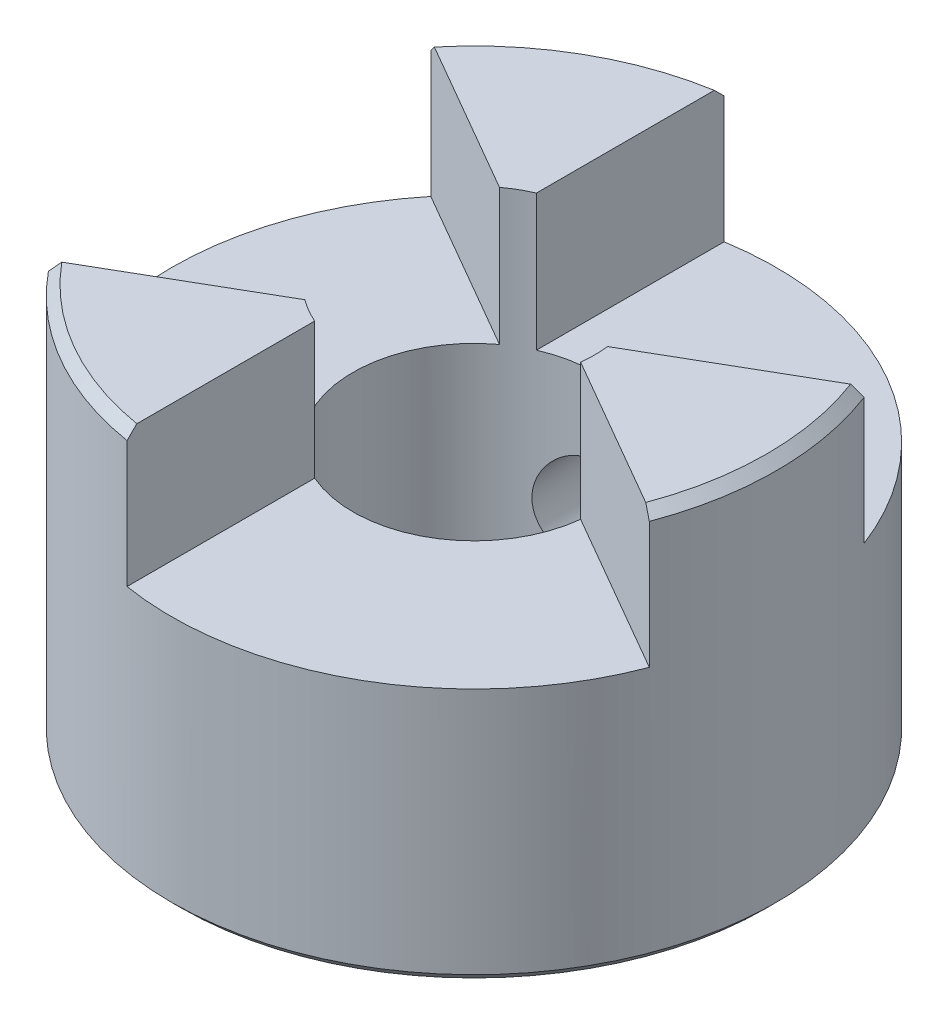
ISO-10303-21;
HEADER;
FILE_DESCRIPTION(('STEP AP214'),'2;1');
FILE_NAME('part.step','',(''),(''),'','','');
FILE_SCHEMA(('AUTOMOTIVE_DESIGN { 1 0 10303 214 1 1 1 1 }'));
ENDSEC;
DATA;
#1=APPLICATION_CONTEXT('core data for automotive mechanical design processes');
#2=APPLICATION_PROTOCOL_DEFINITION('international standard','automotive_design',2000,#1);
#3=PRODUCT_CONTEXT('',#1,'mechanical');
#4=PRODUCT('Part','Part','',(#3));
#5=PRODUCT_RELATED_PRODUCT_CATEGORY('part','',(#4));
#6=PRODUCT_DEFINITION_FORMATION('','',#4);
#7=PRODUCT_DEFINITION_CONTEXT('part definition',#1,'design');
#8=PRODUCT_DEFINITION('design','',#6,#7);
#9=PRODUCT_DEFINITION_SHAPE('','',#8);
#10=(LENGTH_UNIT() NAMED_UNIT(*) SI_UNIT(.MILLI.,.METRE.));
#11=(NAMED_UNIT(*) PLANE_ANGLE_UNIT() SI_UNIT($,.RADIAN.));
#12=(NAMED_UNIT(*) SI_UNIT($,.STERADIAN.) SOLID_ANGLE_UNIT());
#13=UNCERTAINTY_MEASURE_WITH_UNIT(LENGTH_MEASURE(1.E-05),#10,'distance_accuracy_value','');
#14=(GEOMETRIC_REPRESENTATION_CONTEXT(3) GLOBAL_UNCERTAINTY_ASSIGNED_CONTEXT((#13)) GLOBAL_UNIT_ASSIGNED_CONTEXT((#10,
#11,#12)) REPRESENTATION_CONTEXT('',''));
#15=CARTESIAN_POINT('',(0.,0.,0.));
#16=DIRECTION('',(0.,0.,1.));
#17=DIRECTION('',(1.,0.,0.));
#18=AXIS2_PLACEMENT_3D('',#15,#16,#17);
#19=CARTESIAN_POINT('',(0.,6.746875,0.));
#20=DIRECTION('',(0.,1.,0.));
#21=DIRECTION('',(0.,0.,1.));
#22=AXIS2_PLACEMENT_3D('',#19,#20,#21);
#23=PLANE('',#22);
#24=CARTESIAN_POINT('',(0.,6.746875,0.));
#25=DIRECTION('',(0.,1.,0.));
#26=DIRECTION('',(0.,0.,1.));
#27=AXIS2_PLACEMENT_3D('',#24,#25,#26);
#28=CIRCLE('',#27,3.175);
#29=CARTESIAN_POINT('',(3.15507812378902,6.746875,-0.355115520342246));
#30=VERTEX_POINT('',#29);
#31=CARTESIAN_POINT('',(-1.26999999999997,6.746875,-2.90993556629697));
#32=VERTEX_POINT('',#31);
#33=EDGE_CURVE('E176',#30,#32,#28,.T.);
#34=ORIENTED_EDGE('',*,*,#33,.F.);
#35=DIRECTION('',(-0.866025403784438,0.,0.500000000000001));
#36=VECTOR('',#35,1.);
#37=CARTESIAN_POINT('',(2.53999999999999,6.746875,0.));
#38=LINE('',#37,#36);
#39=CARTESIAN_POINT('',(7.42051801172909,6.746875,-2.81776838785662));
#40=VERTEX_POINT('',#39);
#41=EDGE_CURVE('E334',#40,#30,#38,.T.);
#42=ORIENTED_EDGE('',*,*,#41,.F.);
#43=CARTESIAN_POINT('',(0.,6.746875,0.));
#44=DIRECTION('',(0.,1.,0.));
#45=DIRECTION('',(0.,0.,1.));
#46=AXIS2_PLACEMENT_3D('',#43,#44,#45);
#47=CIRCLE('',#46,7.9375);
#48=CARTESIAN_POINT('',(-1.26999999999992,6.746875,-7.83524130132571));
#49=VERTEX_POINT('',#48);
#50=EDGE_CURVE('E168',#40,#49,#47,.T.);
#51=ORIENTED_EDGE('',*,*,#50,.T.);
#52=DIRECTION('',(0.,0.,-1.));
#53=VECTOR('',#52,1.);
#54=CARTESIAN_POINT('',(-1.26999999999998,6.746875,-2.19970452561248));
#55=LINE('',#54,#53);
#56=EDGE_CURVE('E207',#32,#49,#55,.T.);
#57=ORIENTED_EDGE('',*,*,#56,.F.);
#58=EDGE_LOOP('',(#34,#42,#51,#57));
#59=FACE_BOUND('',#58,.T.);
#60=ADVANCED_FACE('F35',(#59),#23,.T.);
#61=CARTESIAN_POINT('',(-1.885078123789,6.746875,-2.55482004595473));
#62=VERTEX_POINT('',#61);
#63=CARTESIAN_POINT('',(-1.88507812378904,6.746875,2.5548200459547));
#64=VERTEX_POINT('',#63);
#65=EDGE_CURVE('E174',#62,#64,#28,.T.);
#66=ORIENTED_EDGE('',*,*,#65,.F.);
#67=DIRECTION('',(0.866025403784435,0.,0.500000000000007));
#68=VECTOR('',#67,1.);
#69=CARTESIAN_POINT('',(-1.26999999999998,6.746875,-2.19970452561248));
#70=LINE('',#69,#68);
#71=CARTESIAN_POINT('',(-6.15051801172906,6.746875,-5.01747291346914));
#72=VERTEX_POINT('',#71);
#73=EDGE_CURVE('E173',#72,#62,#70,.T.);
#74=ORIENTED_EDGE('',*,*,#73,.F.);
#75=CARTESIAN_POINT('',(-6.15051801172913,6.746875,5.01747291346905));
#76=VERTEX_POINT('',#75);
#77=EDGE_CURVE('E358',#72,#76,#47,.T.);
#78=ORIENTED_EDGE('',*,*,#77,.T.);
#79=DIRECTION('',(-0.866025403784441,0.,0.499999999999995));
#80=VECTOR('',#79,1.);
#81=CARTESIAN_POINT('',(-1.27000000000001,6.746875,2.19970452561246));
#82=LINE('',#81,#80);
#83=EDGE_CURVE('E313',#64,#76,#82,.T.);
#84=ORIENTED_EDGE('',*,*,#83,.F.);
#85=EDGE_LOOP('',(#66,#74,#78,#84));
#86=FACE_BOUND('',#85,.T.);
#87=ADVANCED_FACE('F283',(#86),#23,.T.);
#88=CARTESIAN_POINT('',(-1.27000000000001,6.746875,2.90993556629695));
#89=VERTEX_POINT('',#88);
#90=CARTESIAN_POINT('',(3.15507812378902,6.746875,0.355115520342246));
#91=VERTEX_POINT('',#90);
#92=EDGE_CURVE('E178',#89,#91,#28,.T.);
#93=ORIENTED_EDGE('',*,*,#92,.F.);
#94=DIRECTION('',(0.,0.,-1.));
#95=VECTOR('',#94,1.);
#96=CARTESIAN_POINT('',(-1.27000000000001,6.746875,2.19970452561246));
#97=LINE('',#96,#95);
#98=CARTESIAN_POINT('',(-1.27000000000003,6.746875,7.83524130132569));
#99=VERTEX_POINT('',#98);
#100=EDGE_CURVE('E306',#99,#89,#97,.T.);
#101=ORIENTED_EDGE('',*,*,#100,.F.);
#102=CARTESIAN_POINT('',(7.42051801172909,6.746875,2.81776838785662));
#103=VERTEX_POINT('',#102);
#104=EDGE_CURVE('E356',#99,#103,#47,.T.);
#105=ORIENTED_EDGE('',*,*,#104,.T.);
#106=DIRECTION('',(0.866025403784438,0.,0.500000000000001));
#107=VECTOR('',#106,1.);
#108=CARTESIAN_POINT('',(2.53999999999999,6.746875,0.));
#109=LINE('',#108,#107);
#110=EDGE_CURVE('E309',#91,#103,#109,.T.);
#111=ORIENTED_EDGE('',*,*,#110,.F.);
#112=EDGE_LOOP('',(#93,#101,#105,#111));
#113=FACE_BOUND('',#112,.T.);
#114=ADVANCED_FACE('F285',(#113),#23,.T.);
#115=CARTESIAN_POINT('',(0.,6.746875,0.));
#116=DIRECTION('',(0.,-1.,0.));
#117=DIRECTION('',(0.,0.,-1.));
#118=AXIS2_PLACEMENT_3D('',#115,#116,#117);
#119=CYLINDRICAL_SURFACE('',#118,7.9375);
#120=CARTESIAN_POINT('',(0.,4.8968812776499,-7.9375));
#121=CARTESIAN_POINT('',(0.0257225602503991,4.89690131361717,-7.93750336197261));
#122=CARTESIAN_POINT('',(0.0514445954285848,4.89627769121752,-7.93736567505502));
#123=CARTESIAN_POINT('',(0.102786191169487,4.89376404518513,-7.93682267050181));
#124=CARTESIAN_POINT('',(0.128405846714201,4.89187588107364,-7.93641774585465));
#125=CARTESIAN_POINT('',(0.179488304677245,4.88685684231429,-7.93535525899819));
#126=CARTESIAN_POINT('',(0.204951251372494,4.88372737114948,-7.93469798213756));
#127=CARTESIAN_POINT('',(0.255666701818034,4.87624978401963,-7.93314587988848));
#128=CARTESIAN_POINT('',(0.280919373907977,4.87190276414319,-7.93225126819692));
#129=CARTESIAN_POINT('',(0.331160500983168,4.8620138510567,-7.93023951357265));
#130=CARTESIAN_POINT('',(0.356149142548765,4.85647287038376,-7.92912254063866));
#131=CARTESIAN_POINT('',(0.40580848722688,4.84421972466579,-7.92668106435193));
#132=CARTESIAN_POINT('',(0.430479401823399,4.83750838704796,-7.92535670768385));
#133=CARTESIAN_POINT('',(0.479449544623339,4.8229381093,-7.92251544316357));
#134=CARTESIAN_POINT('',(0.503749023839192,4.81507998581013,-7.92099867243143));
#135=CARTESIAN_POINT('',(0.551922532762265,4.79823964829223,-7.91778754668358));
#136=CARTESIAN_POINT('',(0.575796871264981,4.78925829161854,-7.91609332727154));
#137=CARTESIAN_POINT('',(0.623066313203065,4.77019494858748,-7.91254226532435));
#138=CARTESIAN_POINT('',(0.646461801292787,4.76011389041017,-7.91068556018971));
#139=CARTESIAN_POINT('',(0.692719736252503,4.73887457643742,-7.9068244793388));
#140=CARTESIAN_POINT('',(0.715582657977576,4.72771732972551,-7.90482024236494));
#141=CARTESIAN_POINT('',(0.760721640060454,4.70434905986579,-7.90067907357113));
#142=CARTESIAN_POINT('',(0.78299827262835,4.69213911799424,-7.8985422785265));
#143=CARTESIAN_POINT('',(0.82691084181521,4.66668889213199,-7.89415088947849));
#144=CARTESIAN_POINT('',(0.84854744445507,4.65344973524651,-7.89189642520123));
#145=CARTESIAN_POINT('',(0.891126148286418,4.6259645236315,-7.88728490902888));
#146=CARTESIAN_POINT('',(0.912068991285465,4.61171959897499,-7.88492797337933));
#147=CARTESIAN_POINT('',(0.953206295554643,4.58224639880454,-7.88012557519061));
#148=CARTESIAN_POINT('',(0.973401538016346,4.567019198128,-7.87768021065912));
#149=CARTESIAN_POINT('',(1.01299014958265,4.53560482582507,-7.87271932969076));
#150=CARTESIAN_POINT('',(1.0323842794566,4.519418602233,-7.87020388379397));
#151=CARTESIAN_POINT('',(1.07031593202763,4.48611047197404,-7.86510516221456));
#152=CARTESIAN_POINT('',(1.08885410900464,4.46898930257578,-7.86252194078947));
#153=CARTESIAN_POINT('',(1.12500974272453,4.43384646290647,-7.8573518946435));
#154=CARTESIAN_POINT('',(1.14262833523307,4.41582595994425,-7.85476507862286));
#155=CARTESIAN_POINT('',(1.17690832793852,4.37894752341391,-7.84965304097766));
#156=CARTESIAN_POINT('',(1.19357134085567,4.36009110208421,-7.84712771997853));
#157=CARTESIAN_POINT('',(1.22591459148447,4.32159443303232,-7.84214185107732));
#158=CARTESIAN_POINT('',(1.24159627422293,4.30195541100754,-7.83968121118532));
#159=CARTESIAN_POINT('',(1.2719525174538,4.26194618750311,-7.83484389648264));
#160=CARTESIAN_POINT('',(1.28662840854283,4.24157700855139,-7.83246711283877));
#161=CARTESIAN_POINT('',(1.31494831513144,4.20016026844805,-7.82781242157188));
#162=CARTESIAN_POINT('',(1.32859359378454,4.1791135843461,-7.82553439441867));
#163=CARTESIAN_POINT('',(1.35482756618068,4.13639451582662,-7.82109327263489));
#164=CARTESIAN_POINT('',(1.36741749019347,4.11472290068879,-7.81893004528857));
#165=CARTESIAN_POINT('',(1.39151598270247,4.07080663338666,-7.81473427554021));
#166=CARTESIAN_POINT('',(1.40302576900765,4.04856266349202,-7.81270158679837));
#167=CARTESIAN_POINT('',(1.42493920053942,4.00355432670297,-7.8087827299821));
#168=CARTESIAN_POINT('',(1.4353440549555,3.98079056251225,-7.80689640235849));
#169=CARTESIAN_POINT('',(1.45502283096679,3.93479527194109,-7.80328608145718));
#170=CARTESIAN_POINT('',(1.46429793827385,3.91156426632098,-7.80156191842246));
#171=CARTESIAN_POINT('',(1.48169244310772,3.864687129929,-7.79829174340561));
#172=CARTESIAN_POINT('',(1.48981296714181,3.84104142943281,-7.79674555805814));
#173=CARTESIAN_POINT('',(1.50487356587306,3.79338754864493,-7.79384714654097));
#174=CARTESIAN_POINT('',(1.51181464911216,3.76937969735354,-7.79249475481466));
#175=CARTESIAN_POINT('',(1.5244916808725,3.7210541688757,-7.78999972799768));
#176=CARTESIAN_POINT('',(1.53022843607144,3.69673671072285,-7.78885695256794));
#177=CARTESIAN_POINT('',(1.54047223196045,3.64784463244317,-7.78679693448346));
#178=CARTESIAN_POINT('',(1.54497976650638,3.62327011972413,-7.78587960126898));
#179=CARTESIAN_POINT('',(1.55274057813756,3.57391658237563,-7.78428622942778));
#180=CARTESIAN_POINT('',(1.55599389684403,3.54913756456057,-7.78361018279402));
#181=CARTESIAN_POINT('',(1.5612221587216,3.49942769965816,-7.78251506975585));
#182=CARTESIAN_POINT('',(1.56319652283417,3.47449678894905,-7.78209611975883));
#183=CARTESIAN_POINT('',(1.56584187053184,3.42453560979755,-7.78153099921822));
#184=CARTESIAN_POINT('',(1.56651145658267,3.39950526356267,-7.78138512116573));
#185=CARTESIAN_POINT('',(1.56652638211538,3.34944425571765,-7.78138130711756));
#186=CARTESIAN_POINT('',(1.56587172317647,3.3244135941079,-7.78152337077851));
#187=CARTESIAN_POINT('',(1.56326184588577,3.27445079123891,-7.78208008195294));
#188=CARTESIAN_POINT('',(1.56130803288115,3.24951857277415,-7.78249443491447));
#189=CARTESIAN_POINT('',(1.55612427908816,3.19980492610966,-7.78357994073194));
#190=CARTESIAN_POINT('',(1.55289493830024,3.17502343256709,-7.78425097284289));
#191=CARTESIAN_POINT('',(1.54518538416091,3.12566357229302,-7.78583395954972));
#192=CARTESIAN_POINT('',(1.54070515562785,3.10108520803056,-7.78674591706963));
#193=CARTESIAN_POINT('',(1.53051861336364,3.0521838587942,-7.78879496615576));
#194=CARTESIAN_POINT('',(1.52481183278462,3.02786097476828,-7.78993214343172));
#195=CARTESIAN_POINT('',(1.5121968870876,2.97952282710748,-7.79241587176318));
#196=CARTESIAN_POINT('',(1.50528793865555,2.95550777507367,-7.79376255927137));
#197=CARTESIAN_POINT('',(1.49029320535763,2.90783752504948,-7.79664958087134));
#198=CARTESIAN_POINT('',(1.48220642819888,2.88418264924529,-7.79819007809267));
#199=CARTESIAN_POINT('',(1.46488048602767,2.83728499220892,-7.8014490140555));
#200=CARTESIAN_POINT('',(1.45564020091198,2.81404263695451,-7.80316762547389));
#201=CARTESIAN_POINT('',(1.43603161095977,2.76802227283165,-7.80676709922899));
#202=CARTESIAN_POINT('',(1.42566211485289,2.74524478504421,-7.80864813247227));
#203=CARTESIAN_POINT('',(1.40381941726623,2.70020642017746,-7.81255677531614));
#204=CARTESIAN_POINT('',(1.39234498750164,2.67794615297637,-7.81458454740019));
#205=CARTESIAN_POINT('',(1.36831670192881,2.63399450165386,-7.81877097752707));
#206=CARTESIAN_POINT('',(1.35576159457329,2.61230381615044,-7.82092978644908));
#207=CARTESIAN_POINT('',(1.32959622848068,2.56954360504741,-7.82536268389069));
#208=CARTESIAN_POINT('',(1.31598469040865,2.54847487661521,-7.82763691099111));
#209=CARTESIAN_POINT('',(1.28773071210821,2.5070108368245,-7.83228473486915));
#210=CARTESIAN_POINT('',(1.27308694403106,2.48661644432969,-7.83465845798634));
#211=CARTESIAN_POINT('',(1.24279288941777,2.44655334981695,-7.83949050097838));
#212=CARTESIAN_POINT('',(1.22714119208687,2.4268857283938,-7.84194893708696));
#213=CARTESIAN_POINT('',(1.19485527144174,2.38832826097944,-7.8469313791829));
#214=CARTESIAN_POINT('',(1.17821950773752,2.36943971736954,-7.8494554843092));
#215=CARTESIAN_POINT('',(1.143991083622,2.33249298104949,-7.85456615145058));
#216=CARTESIAN_POINT('',(1.12639670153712,2.31443639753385,-7.85715282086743));
#217=CARTESIAN_POINT('',(1.09028721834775,2.27922004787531,-7.86232360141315));
#218=CARTESIAN_POINT('',(1.07177096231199,2.26206146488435,-7.86490770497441));
#219=CARTESIAN_POINT('',(1.03388168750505,2.22868021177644,-7.87000898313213));
#220=CARTESIAN_POINT('',(1.01450807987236,2.21245820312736,-7.87252610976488));
#221=CARTESIAN_POINT('',(0.974959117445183,2.18097365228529,-7.87749103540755));
#222=CARTESIAN_POINT('',(0.954783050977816,2.1657119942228,-7.87993876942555));
#223=CARTESIAN_POINT('',(0.913682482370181,2.13617126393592,-7.88474652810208));
#224=CARTESIAN_POINT('',(0.892757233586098,2.12189321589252,-7.88710646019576));
#225=CARTESIAN_POINT('',(0.850211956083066,2.09434305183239,-7.89172451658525));
#226=CARTESIAN_POINT('',(0.82859120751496,2.08107202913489,-7.89398252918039));
#227=CARTESIAN_POINT('',(0.784708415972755,2.05555929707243,-7.89838149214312));
#228=CARTESIAN_POINT('',(0.762445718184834,2.04331869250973,-7.90052231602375));
#229=CARTESIAN_POINT('',(0.71733251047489,2.01989024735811,-7.904671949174));
#230=CARTESIAN_POINT('',(0.694481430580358,2.00870348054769,-7.90668062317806));
#231=CARTESIAN_POINT('',(0.648244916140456,1.9874062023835,-7.91055091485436));
#232=CARTESIAN_POINT('',(0.624859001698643,1.97729670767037,-7.91241239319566));
#233=CARTESIAN_POINT('',(0.577606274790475,1.95817749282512,-7.91597326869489));
#234=CARTESIAN_POINT('',(0.553739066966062,1.94916872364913,-7.91767252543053));
#235=CARTESIAN_POINT('',(0.505577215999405,1.93227448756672,-7.92089392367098));
#236=CARTESIAN_POINT('',(0.481282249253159,1.92438991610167,-7.92241592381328));
#237=CARTESIAN_POINT('',(0.432318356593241,1.90976759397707,-7.92526777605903));
#238=CARTESIAN_POINT('',(0.407649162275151,1.90303071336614,-7.92659748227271));
#239=CARTESIAN_POINT('',(0.357990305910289,1.89072725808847,-7.92904971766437));
#240=CARTESIAN_POINT('',(0.333000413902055,1.88516157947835,-7.93017208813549));
#241=CARTESIAN_POINT('',(0.282753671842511,1.87522397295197,-7.93219463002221));
#242=CARTESIAN_POINT('',(0.25749661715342,1.87085304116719,-7.93309461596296));
#243=CARTESIAN_POINT('',(0.206769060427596,1.86332825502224,-7.93465738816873));
#244=CARTESIAN_POINT('',(0.181298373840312,1.86017559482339,-7.93531994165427));
#245=CARTESIAN_POINT('',(0.130197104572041,1.85511074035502,-7.93639284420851));
#246=CARTESIAN_POINT('',(0.104566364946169,1.85320006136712,-7.93680288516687));
#247=CARTESIAN_POINT('',(0.0531983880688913,1.85064183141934,-7.93735588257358));
#248=CARTESIAN_POINT('',(0.027461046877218,1.84999626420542,-7.93749841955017));
#249=CARTESIAN_POINT('',(-0.0240244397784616,1.84999302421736,-7.93750120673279));
#250=CARTESIAN_POINT('',(-0.0497725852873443,1.85063588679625,-7.93736133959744));
#251=CARTESIAN_POINT('',(-0.101181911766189,1.85319068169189,-7.9368133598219));
#252=CARTESIAN_POINT('',(-0.126843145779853,1.85510159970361,-7.9364054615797));
#253=CARTESIAN_POINT('',(-0.178022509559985,1.86016746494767,-7.9353366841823));
#254=CARTESIAN_POINT('',(-0.20354071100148,1.86332171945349,-7.93467594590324));
#255=CARTESIAN_POINT('',(-0.25437773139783,1.87085001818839,-7.93311660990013));
#256=CARTESIAN_POINT('',(-0.279696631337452,1.87522353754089,-7.93221811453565));
#257=CARTESIAN_POINT('',(-0.330078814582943,1.8851661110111,-7.93019837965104));
#258=CARTESIAN_POINT('',(-0.355142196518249,1.89073468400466,-7.9290772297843));
#259=CARTESIAN_POINT('',(-0.40495708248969,1.90304327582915,-7.92662726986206));
#260=CARTESIAN_POINT('',(-0.429708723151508,1.90978276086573,-7.92529855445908));
#261=CARTESIAN_POINT('',(-0.47884384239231,1.92440917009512,-7.92244853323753));
#262=CARTESIAN_POINT('',(-0.503227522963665,1.93229543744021,-7.92092733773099));
#263=CARTESIAN_POINT('',(-0.55157040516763,1.94919147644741,-7.91770741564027));
#264=CARTESIAN_POINT('',(-0.575529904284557,1.95820042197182,-7.91600881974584));
#265=CARTESIAN_POINT('',(-0.622968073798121,1.97731792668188,-7.9124491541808));
#266=CARTESIAN_POINT('',(-0.646447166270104,1.98742546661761,-7.91058823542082));
#267=CARTESIAN_POINT('',(-0.692868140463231,2.00871629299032,-7.90671897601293));
#268=CARTESIAN_POINT('',(-0.715810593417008,2.0198983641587,-7.90471080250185));
#269=CARTESIAN_POINT('',(-0.761101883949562,2.0433143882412,-7.9005621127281));
#270=CARTESIAN_POINT('',(-0.783451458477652,2.05554694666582,-7.89842177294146));
#271=CARTESIAN_POINT('',(-0.827500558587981,2.08104006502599,-7.89402375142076));
#272=CARTESIAN_POINT('',(-0.849200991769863,2.09429908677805,-7.89176624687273));
#273=CARTESIAN_POINT('',(-0.891895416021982,2.12182121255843,-7.88714922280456));
#274=CARTESIAN_POINT('',(-0.912890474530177,2.13608268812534,-7.88478987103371));
#275=CARTESIAN_POINT('',(-0.954117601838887,2.16558576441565,-7.87998330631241));
#276=CARTESIAN_POINT('',(-0.974350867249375,2.18082571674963,-7.87753624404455));
#277=CARTESIAN_POINT('',(-1.01399851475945,2.21226166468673,-7.87257282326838));
#278=CARTESIAN_POINT('',(-1.03341416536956,2.22845607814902,-7.87005658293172));
#279=CARTESIAN_POINT('',(-1.07136843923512,2.26177698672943,-7.86495698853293));
#280=CARTESIAN_POINT('',(-1.08990831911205,2.27890206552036,-7.86237373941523));
#281=CARTESIAN_POINT('',(-1.12605368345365,2.31405177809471,-7.85720447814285));
#282=CARTESIAN_POINT('',(-1.14366067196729,2.33207486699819,-7.85461847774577));
#283=CARTESIAN_POINT('',(-1.17791399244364,2.36895925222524,-7.84950888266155));
#284=CARTESIAN_POINT('',(-1.19456198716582,2.38781899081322,-7.84698518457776));
#285=CARTESIAN_POINT('',(-1.22687149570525,2.42632335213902,-7.84200306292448));
#286=CARTESIAN_POINT('',(-1.24253449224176,2.44596671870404,-7.83954454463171));
#287=CARTESIAN_POINT('',(-1.27285044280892,2.48598496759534,-7.83471196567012));
#288=CARTESIAN_POINT('',(-1.2875047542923,2.50635880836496,-7.83233779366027));
#289=CARTESIAN_POINT('',(-1.31577908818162,2.54778476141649,-7.82768872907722));
#290=CARTESIAN_POINT('',(-1.32940039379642,2.56883598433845,-7.82541371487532));
#291=CARTESIAN_POINT('',(-1.35558458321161,2.61156350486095,-7.82097895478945));
#292=CARTESIAN_POINT('',(-1.36814871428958,2.63323902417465,-7.81881907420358));
#293=CARTESIAN_POINT('',(-1.39219433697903,2.67716198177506,-7.81463026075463));
#294=CARTESIAN_POINT('',(-1.40367706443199,2.69940872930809,-7.81260117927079));
#295=CARTESIAN_POINT('',(-1.4255356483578,2.74442100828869,-7.80868972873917));
#296=CARTESIAN_POINT('',(-1.4359127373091,2.76718592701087,-7.80680719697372));
#297=CARTESIAN_POINT('',(-1.45553580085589,2.81318142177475,-7.80320458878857));
#298=CARTESIAN_POINT('',(-1.46478299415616,2.8364114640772,-7.80148433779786));
#299=CARTESIAN_POINT('',(-1.48212203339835,2.88328407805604,-7.79822203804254));
#300=CARTESIAN_POINT('',(-1.49021505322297,2.90692620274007,-7.79667980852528));
#301=CARTESIAN_POINT('',(-1.50522154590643,2.95456984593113,-7.79378929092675));
#302=CARTESIAN_POINT('',(-1.51213609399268,2.9785710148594,-7.79244082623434));
#303=CARTESIAN_POINT('',(-1.52476148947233,3.02687960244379,-7.78995356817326));
#304=CARTESIAN_POINT('',(-1.53047323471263,3.05118677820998,-7.78881461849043));
#305=CARTESIAN_POINT('',(-1.54066898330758,3.10005422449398,-7.78676209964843));
#306=CARTESIAN_POINT('',(-1.54515360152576,3.12461436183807,-7.78584841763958));
#307=CARTESIAN_POINT('',(-1.55287104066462,3.17393458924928,-7.78426213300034));
#308=CARTESIAN_POINT('',(-1.55610405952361,3.19869464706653,-7.78358949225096));
#309=CARTESIAN_POINT('',(-1.5612948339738,3.24836153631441,-7.78250090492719));
#310=CARTESIAN_POINT('',(-1.56325220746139,3.27326840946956,-7.78208503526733));
#311=CARTESIAN_POINT('',(-1.56586669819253,3.32317596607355,-7.78152575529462));
#312=CARTESIAN_POINT('',(-1.56652266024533,3.34817671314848,-7.78138258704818));
#313=CARTESIAN_POINT('',(-1.56651585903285,3.39817730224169,-7.78138370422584));
#314=CARTESIAN_POINT('',(-1.56585312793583,3.42317714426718,-7.78152798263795));
#315=CARTESIAN_POINT('',(-1.56323385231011,3.47308173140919,-7.78208849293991));
#316=CARTESIAN_POINT('',(-1.56127853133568,3.49798654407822,-7.78250446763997));
#317=CARTESIAN_POINT('',(-1.55609681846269,3.54764853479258,-7.78359269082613));
#318=CARTESIAN_POINT('',(-1.55287088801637,3.57240576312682,-7.78426484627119));
#319=CARTESIAN_POINT('',(-1.54517216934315,3.62171998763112,-7.78584961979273));
#320=CARTESIAN_POINT('',(-1.5406992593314,3.64627696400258,-7.78676226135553));
#321=CARTESIAN_POINT('',(-1.53053016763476,3.69513816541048,-7.78881229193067));
#322=CARTESIAN_POINT('',(-1.52483343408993,3.71944227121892,-7.78994978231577));
#323=CARTESIAN_POINT('',(-1.51224025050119,3.76774522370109,-7.79243381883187));
#324=CARTESIAN_POINT('',(-1.50534294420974,3.79174383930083,-7.79378051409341));
#325=CARTESIAN_POINT('',(-1.49037201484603,3.83938331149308,-7.79666730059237));
#326=CARTESIAN_POINT('',(-1.48229732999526,3.86302382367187,-7.79820756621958));
#327=CARTESIAN_POINT('',(-1.46499495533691,3.90989458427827,-7.80146585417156));
#328=CARTESIAN_POINT('',(-1.45576607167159,3.93312437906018,-7.80318406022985));
#329=CARTESIAN_POINT('',(-1.43617853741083,3.97912119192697,-7.80678260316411));
#330=CARTESIAN_POINT('',(-1.42581861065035,4.0018876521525,-7.80866312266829));
#331=CARTESIAN_POINT('',(-1.40399218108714,4.04690527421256,-7.81257068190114));
#332=CARTESIAN_POINT('',(-1.39252434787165,4.06915577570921,-7.8145978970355));
#333=CARTESIAN_POINT('',(-1.36850526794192,4.11308895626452,-7.8187832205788));
#334=CARTESIAN_POINT('',(-1.35595264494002,4.13477086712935,-7.8209414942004));
#335=CARTESIAN_POINT('',(-1.32978714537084,4.17751434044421,-7.82537339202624));
#336=CARTESIAN_POINT('',(-1.31617283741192,4.19857501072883,-7.82764717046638));
#337=CARTESIAN_POINT('',(-1.28790711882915,4.24002351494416,-7.83229423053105));
#338=CARTESIAN_POINT('',(-1.2732541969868,4.26041030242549,-7.83466765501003));
#339=CARTESIAN_POINT('',(-1.24293449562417,4.30045849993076,-7.83949930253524));
#340=CARTESIAN_POINT('',(-1.22726608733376,4.32011866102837,-7.84195765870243));
#341=CARTESIAN_POINT('',(-1.19493843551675,4.35866142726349,-7.84694019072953));
#342=CARTESIAN_POINT('',(-1.17827739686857,4.37754251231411,-7.84946448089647));
#343=CARTESIAN_POINT('',(-1.14398852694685,4.41447384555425,-7.85457590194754));
#344=CARTESIAN_POINT('',(-1.12635868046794,4.43252220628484,-7.85716315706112));
#345=CARTESIAN_POINT('',(-1.09017088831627,4.46772155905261,-7.86233503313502));
#346=CARTESIAN_POINT('',(-1.07161154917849,4.48487111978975,-7.86491964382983));
#347=CARTESIAN_POINT('',(-1.03363281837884,4.51823446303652,-7.87002146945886));
#348=CARTESIAN_POINT('',(-1.0142126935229,4.53444741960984,-7.87253862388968));
#349=CARTESIAN_POINT('',(-0.974567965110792,4.56591377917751,-7.87750328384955));
#350=CARTESIAN_POINT('',(-0.954342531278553,4.58116614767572,-7.87995071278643));
#351=CARTESIAN_POINT('',(-0.913141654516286,4.61068862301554,-7.88475758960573));
#352=CARTESIAN_POINT('',(-0.892165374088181,4.62495757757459,-7.88711693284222));
#353=CARTESIAN_POINT('',(-0.849517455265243,4.65249011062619,-7.89173361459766));
#354=CARTESIAN_POINT('',(-0.827845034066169,4.66575249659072,-7.89399083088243));
#355=CARTESIAN_POINT('',(-0.783859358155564,4.69124878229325,-7.89838807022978));
#356=CARTESIAN_POINT('',(-0.761545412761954,4.70348151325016,-7.90052795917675));
#357=CARTESIAN_POINT('',(-0.716331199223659,4.72689529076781,-7.90467565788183));
#358=CARTESIAN_POINT('',(-0.69343035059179,4.73807524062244,-7.90668332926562));
#359=CARTESIAN_POINT('',(-0.647096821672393,4.75936021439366,-7.91055161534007));
#360=CARTESIAN_POINT('',(-0.62366367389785,4.76946424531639,-7.91241209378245));
#361=CARTESIAN_POINT('',(-0.576320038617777,4.78857410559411,-7.91597103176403));
#362=CARTESIAN_POINT('',(-0.55240918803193,4.79757905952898,-7.91766936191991));
#363=CARTESIAN_POINT('',(-0.504164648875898,4.81446747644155,-7.92088903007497));
#364=CARTESIAN_POINT('',(-0.479830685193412,4.82235017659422,-7.92241024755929));
#365=CARTESIAN_POINT('',(-0.430794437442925,4.83697080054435,-7.92526071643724));
#366=CARTESIAN_POINT('',(-0.406091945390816,4.84370804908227,-7.92658985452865));
#367=CARTESIAN_POINT('',(-0.356373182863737,4.85601451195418,-7.92904119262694));
#368=CARTESIAN_POINT('',(-0.331356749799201,4.86158309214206,-7.93016328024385));
#369=CARTESIAN_POINT('',(-0.281064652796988,4.87152899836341,-7.93218554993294));
#370=CARTESIAN_POINT('',(-0.255788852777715,4.87590566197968,-7.93308560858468));
#371=CARTESIAN_POINT('',(-0.205032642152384,4.88344461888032,-7.93464887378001));
#372=CARTESIAN_POINT('',(-0.179552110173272,4.8866061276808,-7.93531192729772));
#373=CARTESIAN_POINT('',(-0.128440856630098,4.89169162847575,-7.93638622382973));
#374=CARTESIAN_POINT('',(-0.102810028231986,4.89361459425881,-7.93679725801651));
#375=CARTESIAN_POINT('',(-0.051453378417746,4.89620045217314,-7.93735270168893));
#376=CARTESIAN_POINT('',(-0.0257274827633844,4.89686193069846,-7.93749681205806));
#377=CARTESIAN_POINT('',(0.,4.8968812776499,-7.9375));
#378=B_SPLINE_CURVE_WITH_KNOTS('',3,(#120,#121,#122,#123,#124,#125,#126,#127,#128,#129,#130,
#131,#132,#133,#134,#135,#136,#137,#138,#139,#140,#141,#142,#143,#144,#145,#146,#147,#148,#149,
#150,#151,#152,#153,#154,#155,#156,#157,#158,#159,#160,#161,#162,#163,#164,#165,#166,#167,#168,
#169,#170,#171,#172,#173,#174,#175,#176,#177,#178,#179,#180,#181,#182,#183,#184,#185,#186,#187,
#188,#189,#190,#191,#192,#193,#194,#195,#196,#197,#198,#199,#200,#201,#202,#203,#204,#205,#206,
#207,#208,#209,#210,#211,#212,#213,#214,#215,#216,#217,#218,#219,#220,#221,#222,#223,#224,#225,
#226,#227,#228,#229,#230,#231,#232,#233,#234,#235,#236,#237,#238,#239,#240,#241,#242,#243,#244,
#245,#246,#247,#248,#249,#250,#251,#252,#253,#254,#255,#256,#257,#258,#259,#260,#261,#262,#263,
#264,#265,#266,#267,#268,#269,#270,#271,#272,#273,#274,#275,#276,#277,#278,#279,#280,#281,#282,
#283,#284,#285,#286,#287,#288,#289,#290,#291,#292,#293,#294,#295,#296,#297,#298,#299,#300,#301,
#302,#303,#304,#305,#306,#307,#308,#309,#310,#311,#312,#313,#314,#315,#316,#317,#318,#319,#320,
#321,#322,#323,#324,#325,#326,#327,#328,#329,#330,#331,#332,#333,#334,#335,#336,#337,#338,#339,
#340,#341,#342,#343,#344,#345,#346,#347,#348,#349,#350,#351,#352,#353,#354,#355,#356,#357,#358,
#359,#360,#361,#362,#363,#364,#365,#366,#367,#368,#369,#370,#371,#372,#373,#374,#375,#376,#377),
.UNSPECIFIED.,.F.,.F.,(4,2,2,2,2,2,2,2,2,2,2,2,2,2,2,2,2,2,2,2,2,2,2,2,2,2,2,2,2,2,2,2,2,2,2,2,
2,2,2,2,2,2,2,2,2,2,2,2,2,2,2,2,2,2,2,2,2,2,2,2,2,2,2,2,2,2,2,2,2,2,2,2,2,2,2,2,2,2,2,2,2,2,2,2,
2,2,2,2,2,2,2,2,2,2,2,2,2,2,2,2,2,2,2,2,2,2,2,2,2,2,2,2,2,2,2,2,2,2,2,2,2,2,2,2,2,2,2,2,4),(0.,
0.0771577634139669,0.154202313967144,0.231160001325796,0.308048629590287,0.38487869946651,
0.46165467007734,0.538376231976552,0.615039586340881,0.691638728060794,0.768166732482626,
0.844617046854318,0.920984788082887,0.997268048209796,1.07346920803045,1.14959625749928,
1.22566411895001,1.30163569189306,1.37747502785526,1.45319992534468,1.52882262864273,
1.60435108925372,1.67979024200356,1.75514329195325,1.83041301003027,1.90560303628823,
1.98071918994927,2.05577078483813,2.13077194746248,2.20574293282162,2.28071143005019,
2.35571384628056,2.43079655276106,2.50587916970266,2.58088069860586,2.65584698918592,
2.73081418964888,2.80580997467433,2.88085481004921,2.95596323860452,3.03114517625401,
3.10640721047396,3.18175389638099,3.25718904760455,3.33271702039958,3.40834398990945,
3.4840792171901,3.55993630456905,3.63593443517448,3.71203029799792,3.78817926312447,
3.86439733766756,3.9406936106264,4.01707156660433,4.09353039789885,4.17006631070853,
4.24667382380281,4.32334705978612,4.40008103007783,4.47687291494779,4.55372333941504,
4.63063764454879,4.70762715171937,4.78471041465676,4.86191445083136,4.93915057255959,
5.01632498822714,5.09345646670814,5.17055479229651,5.24762213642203,5.32465443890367,
5.4016427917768,5.47857482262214,5.55543607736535,5.63221140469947,5.70888634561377,
5.78544853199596,5.8618890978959,5.93820410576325,6.01439598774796,6.09047499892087,
6.16642736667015,6.24224381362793,6.31794325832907,6.39353875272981,6.46903874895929,
6.54444838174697,6.61977076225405,6.69500828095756,6.77016391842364,6.84524256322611,
6.92025233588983,6.99520591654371,7.07012187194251,7.14502597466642,7.21995250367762,
7.29494551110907,7.36993668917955,7.4448569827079,7.51975009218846,7.59465051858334,
7.66958479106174,7.74457272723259,7.8196287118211,7.89476298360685,7.96998292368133,
8.04529434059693,8.1207027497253,8.19621464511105,8.27183876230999,8.34758733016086,
8.4234773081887,8.49953160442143,8.57570354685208,8.65194166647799,8.72826053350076,
8.80466735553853,8.88116333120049,8.95774499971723,9.03440558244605,9.11113631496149,
9.1879277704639,9.2647711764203,9.34165972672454,9.41858989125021,9.49556272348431,
9.57258516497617,9.64967134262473,9.72684385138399),.UNSPECIFIED.);
#379=CARTESIAN_POINT('',(0.,4.8968812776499,-7.9375));
#380=VERTEX_POINT('',#379);
#381=EDGE_CURVE('E400',#380,#380,#378,.F.);
#382=ORIENTED_EDGE('',*,*,#381,.T.);
#383=EDGE_LOOP('',(#382));
#384=FACE_BOUND('',#383,.T.);
#385=CARTESIAN_POINT('',(0.,0.254000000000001,0.));
#386=DIRECTION('',(0.,1.,0.));
#387=DIRECTION('',(0.,0.,1.));
#388=AXIS2_PLACEMENT_3D('',#385,#386,#387);
#389=CIRCLE('',#388,7.9375);
#390=CARTESIAN_POINT('',(0.,0.254000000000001,7.9375));
#391=VERTEX_POINT('',#390);
#392=EDGE_CURVE('E344',#391,#391,#389,.T.);
#393=ORIENTED_EDGE('',*,*,#392,.T.);
#394=EDGE_LOOP('',(#393));
#395=FACE_BOUND('',#394,.T.);
#396=DIRECTION('',(0.,-1.,0.));
#397=VECTOR('',#396,1.);
#398=CARTESIAN_POINT('',(-1.27000000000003,28.4408506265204,7.83524130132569));
#399=LINE('',#398,#397);
#400=CARTESIAN_POINT('',(-1.27000000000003,10.06475,7.83524130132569));
#401=VERTEX_POINT('',#400);
#402=EDGE_CURVE('E312',#401,#99,#399,.T.);
#403=ORIENTED_EDGE('',*,*,#402,.F.);
#404=CARTESIAN_POINT('',(0.,10.06475,0.));
#405=DIRECTION('',(0.,1.,0.));
#406=DIRECTION('',(0.,0.,1.));
#407=AXIS2_PLACEMENT_3D('',#404,#405,#406);
#408=CIRCLE('',#407,7.9375);
#409=CARTESIAN_POINT('',(-6.15051801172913,10.06475,5.01747291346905));
#410=VERTEX_POINT('',#409);
#411=EDGE_CURVE('E593',#401,#410,#408,.F.);
#412=ORIENTED_EDGE('',*,*,#411,.T.);
#413=DIRECTION('',(0.,-1.,0.));
#414=VECTOR('',#413,1.);
#415=CARTESIAN_POINT('',(-6.15051801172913,28.4408506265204,5.01747291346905));
#416=LINE('',#415,#414);
#417=EDGE_CURVE('E157',#410,#76,#416,.T.);
#418=ORIENTED_EDGE('',*,*,#417,.T.);
#419=ORIENTED_EDGE('',*,*,#77,.F.);
#420=DIRECTION('',(0.,-1.,0.));
#421=VECTOR('',#420,1.);
#422=CARTESIAN_POINT('',(-6.15051801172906,28.4408506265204,-5.01747291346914));
#423=LINE('',#422,#421);
#424=CARTESIAN_POINT('',(-6.15051801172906,10.06475,-5.01747291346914));
#425=VERTEX_POINT('',#424);
#426=EDGE_CURVE('E377',#425,#72,#423,.T.);
#427=ORIENTED_EDGE('',*,*,#426,.F.);
#428=CARTESIAN_POINT('',(0.,10.06475,0.));
#429=DIRECTION('',(0.,1.,0.));
#430=DIRECTION('',(0.,0.,1.));
#431=AXIS2_PLACEMENT_3D('',#428,#429,#430);
#432=CIRCLE('',#431,7.9375);
#433=CARTESIAN_POINT('',(-1.26999999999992,10.06475,-7.83524130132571));
#434=VERTEX_POINT('',#433);
#435=EDGE_CURVE('E375',#425,#434,#432,.F.);
#436=ORIENTED_EDGE('',*,*,#435,.T.);
#437=DIRECTION('',(0.,-1.,0.));
#438=VECTOR('',#437,1.);
#439=CARTESIAN_POINT('',(-1.26999999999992,28.4408506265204,-7.83524130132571));
#440=LINE('',#439,#438);
#441=EDGE_CURVE('E206',#434,#49,#440,.T.);
#442=ORIENTED_EDGE('',*,*,#441,.T.);
#443=ORIENTED_EDGE('',*,*,#50,.F.);
#444=DIRECTION('',(0.,-1.,0.));
#445=VECTOR('',#444,1.);
#446=CARTESIAN_POINT('',(7.42051801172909,28.4408506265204,-2.81776838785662));
#447=LINE('',#446,#445);
#448=CARTESIAN_POINT('',(7.42051801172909,10.06475,-2.81776838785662));
#449=VERTEX_POINT('',#448);
#450=EDGE_CURVE('E345',#449,#40,#447,.T.);
#451=ORIENTED_EDGE('',*,*,#450,.F.);
#452=CARTESIAN_POINT('',(0.,10.06475,0.));
#453=DIRECTION('',(0.,1.,0.));
#454=DIRECTION('',(0.,0.,1.));
#455=AXIS2_PLACEMENT_3D('',#452,#453,#454);
#456=CIRCLE('',#455,7.9375);
#457=CARTESIAN_POINT('',(7.42051801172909,10.06475,2.81776838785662));
#458=VERTEX_POINT('',#457);
#459=EDGE_CURVE('E596',#449,#458,#456,.F.);
#460=ORIENTED_EDGE('',*,*,#459,.T.);
#461=DIRECTION('',(0.,-1.,0.));
#462=VECTOR('',#461,1.);
#463=CARTESIAN_POINT('',(7.42051801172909,28.4408506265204,2.81776838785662));
#464=LINE('',#463,#462);
#465=EDGE_CURVE('E323',#458,#103,#464,.T.);
#466=ORIENTED_EDGE('',*,*,#465,.T.);
#467=ORIENTED_EDGE('',*,*,#104,.F.);
#468=EDGE_LOOP('',(#403,#412,#418,#419,#427,#436,#442,#443,#451,#460,#466,#467));
#469=FACE_BOUND('',#468,.T.);
#470=ADVANCED_FACE('F293',(#384,#395,#469),#119,.T.);
#471=CARTESIAN_POINT('',(0.,0.,0.));
#472=DIRECTION('',(0.,1.,0.));
#473=DIRECTION('',(0.,0.,1.));
#474=AXIS2_PLACEMENT_3D('',#471,#472,#473);
#475=PLANE('',#474);
#476=CARTESIAN_POINT('',(0.,0.,0.));
#477=DIRECTION('',(0.,1.,0.));
#478=DIRECTION('',(0.,0.,1.));
#479=AXIS2_PLACEMENT_3D('',#476,#477,#478);
#480=CIRCLE('',#479,3.429);
#481=CARTESIAN_POINT('',(0.,0.,3.429));
#482=VERTEX_POINT('',#481);
#483=EDGE_CURVE('E341',#482,#482,#480,.T.);
#484=ORIENTED_EDGE('',*,*,#483,.T.);
#485=EDGE_LOOP('',(#484));
#486=FACE_BOUND('',#485,.T.);
#487=CARTESIAN_POINT('',(0.,0.,0.));
#488=DIRECTION('',(0.,1.,0.));
#489=DIRECTION('',(0.,0.,1.));
#490=AXIS2_PLACEMENT_3D('',#487,#488,#489);
#491=CIRCLE('',#490,7.6835);
#492=CARTESIAN_POINT('',(0.,0.,7.6835));
#493=VERTEX_POINT('',#492);
#494=EDGE_CURVE('E338',#493,#493,#491,.F.);
#495=ORIENTED_EDGE('',*,*,#494,.T.);
#496=EDGE_LOOP('',(#495));
#497=FACE_BOUND('',#496,.T.);
#498=ADVANCED_FACE('F298',(#486,#497),#475,.F.);
#499=CARTESIAN_POINT('',(0.,3.3734375,-7.9375));
#500=DIRECTION('',(0.,0.,1.));
#501=DIRECTION('',(1.,0.,0.));
#502=AXIS2_PLACEMENT_3D('',#499,#500,#501);
#503=CYLINDRICAL_SURFACE('',#502,1.35255);
#504=CARTESIAN_POINT('',(0.,4.7259875,-7.71923788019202));
#505=CARTESIAN_POINT('',(-0.355651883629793,4.72570793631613,-7.71918699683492));
#506=CARTESIAN_POINT('',(-0.706842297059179,4.57943456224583,-7.68404520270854));
#507=CARTESIAN_POINT('',(-1.20695788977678,4.0792288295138,-7.60320078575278));
#508=CARTESIAN_POINT('',(-1.35248736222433,3.7285861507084,-7.56742453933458));
#509=CARTESIAN_POINT('',(-1.35261259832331,3.01782684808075,-7.56740318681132));
#510=CARTESIAN_POINT('',(-1.20634238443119,2.66699618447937,-7.6032678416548));
#511=CARTESIAN_POINT('',(-0.706969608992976,2.1676018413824,-7.68405567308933));
#512=CARTESIAN_POINT('',(-0.354395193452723,2.02085946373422,-7.71926042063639));
#513=CARTESIAN_POINT('',(0.357371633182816,2.02091717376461,-7.7192149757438));
#514=CARTESIAN_POINT('',(0.707463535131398,2.16738817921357,-7.68402383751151));
#515=CARTESIAN_POINT('',(1.20646580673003,2.66782772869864,-7.60320163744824));
#516=CARTESIAN_POINT('',(1.35264313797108,3.01851718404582,-7.56738584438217));
#517=CARTESIAN_POINT('',(1.35245623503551,3.73019959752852,-7.5674420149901));
#518=CARTESIAN_POINT('',(1.205556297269,4.08080347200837,-7.60340231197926));
#519=CARTESIAN_POINT('',(0.705937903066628,4.58016555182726,-7.68420969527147));
#520=CARTESIAN_POINT('',(0.355651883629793,4.72626706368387,-7.71928876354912));
#521=CARTESIAN_POINT('',(0.,4.7259875,-7.71923788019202));
#522=B_SPLINE_CURVE_WITH_KNOTS('',3,(#504,#505,#506,#507,#508,#509,#510,#511,#512,#513,#514,
#515,#516,#517,#518,#519,#520,#521),.UNSPECIFIED.,.T.,.F.,(4,2,2,2,2,2,2,2,4),
(0.000372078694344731,0.00156529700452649,0.00275851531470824,0.00395173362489,
0.00514495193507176,0.00633817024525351,0.00753138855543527,0.00872460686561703,
0.00991782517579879),.UNSPECIFIED.);
#523=CARTESIAN_POINT('',(0.,4.7259875,-7.71923788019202));
#524=VERTEX_POINT('',#523);
#525=EDGE_CURVE('E396',#524,#524,#522,.F.);
#526=ORIENTED_EDGE('',*,*,#525,.T.);
#527=EDGE_LOOP('',(#526));
#528=FACE_BOUND('',#527,.T.);
#529=CARTESIAN_POINT('',(1.35255,3.3734375,-2.87249603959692));
#530=CARTESIAN_POINT('',(1.35254144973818,3.44541189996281,-2.87250445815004));
#531=CARTESIAN_POINT('',(1.34676854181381,3.51749684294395,-2.87524078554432));
#532=CARTESIAN_POINT('',(1.32390472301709,3.65957630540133,-2.88583587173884));
#533=CARTESIAN_POINT('',(1.30678372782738,3.7295647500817,-2.89370824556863));
#534=CARTESIAN_POINT('',(1.26202139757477,3.86513472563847,-2.91350625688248));
#535=CARTESIAN_POINT('',(1.23442426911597,3.93073343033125,-2.92541484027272));
#536=CARTESIAN_POINT('',(1.16962319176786,4.05635196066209,-2.95191923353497));
#537=CARTESIAN_POINT('',(1.13242121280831,4.11637292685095,-2.96651449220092));
#538=CARTESIAN_POINT('',(1.04687753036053,4.23307503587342,-2.9978097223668));
#539=CARTESIAN_POINT('',(0.998007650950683,4.28934952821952,-3.01458309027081));
#540=CARTESIAN_POINT('',(0.891623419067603,4.39320634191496,-3.04774273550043));
#541=CARTESIAN_POINT('',(0.834105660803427,4.44078522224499,-3.06412885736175));
#542=CARTESIAN_POINT('',(0.708832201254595,4.52800787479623,-3.09556678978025));
#543=CARTESIAN_POINT('',(0.640728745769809,4.56718963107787,-3.11052339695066));
#544=CARTESIAN_POINT('',(0.498144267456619,4.63336307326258,-3.13651336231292));
#545=CARTESIAN_POINT('',(0.423666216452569,4.66036040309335,-3.14754853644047));
#546=CARTESIAN_POINT('',(0.27472053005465,4.69991091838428,-3.16393095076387));
#547=CARTESIAN_POINT('',(0.20047034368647,4.71316655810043,-3.16955362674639));
#548=CARTESIAN_POINT('',(0.0506011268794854,4.72713175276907,-3.17548089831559));
#549=CARTESIAN_POINT('',(-0.0250173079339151,4.72784664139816,-3.17578775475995));
#550=CARTESIAN_POINT('',(-0.170351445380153,4.71706825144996,-3.17120780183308));
#551=CARTESIAN_POINT('',(-0.24013682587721,4.70634807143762,-3.16664987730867));
#552=CARTESIAN_POINT('',(-0.376807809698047,4.67433507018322,-3.15330892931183));
#553=CARTESIAN_POINT('',(-0.443693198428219,4.65304146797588,-3.14452559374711));
#554=CARTESIAN_POINT('',(-0.573900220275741,4.60023949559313,-3.12340905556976));
#555=CARTESIAN_POINT('',(-0.637151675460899,4.56857983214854,-3.11102359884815));
#556=CARTESIAN_POINT('',(-0.757610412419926,4.49609687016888,-3.08390486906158));
#557=CARTESIAN_POINT('',(-0.814815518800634,4.45527028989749,-3.06917075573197));
#558=CARTESIAN_POINT('',(-0.926009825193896,4.36214069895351,-3.03755045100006));
#559=CARTESIAN_POINT('',(-0.979456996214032,4.3092163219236,-3.02058567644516));
#560=CARTESIAN_POINT('',(-1.076958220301,4.19513484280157,-2.9872139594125));
#561=CARTESIAN_POINT('',(-1.12100831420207,4.13397428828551,-2.97080725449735));
#562=CARTESIAN_POINT('',(-1.19994681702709,4.00241150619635,-2.93983313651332));
#563=CARTESIAN_POINT('',(-1.23445242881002,3.93175746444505,-2.92535219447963));
#564=CARTESIAN_POINT('',(-1.29085203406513,3.78486152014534,-2.90091053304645));
#565=CARTESIAN_POINT('',(-1.31275551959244,3.7086238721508,-2.89094641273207));
#566=CARTESIAN_POINT('',(-1.34191654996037,3.55816490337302,-2.8775210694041));
#567=CARTESIAN_POINT('',(-1.35005610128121,3.48415005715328,-2.87366929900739));
#568=CARTESIAN_POINT('',(-1.3540586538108,3.3357277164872,-2.87178659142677));
#569=CARTESIAN_POINT('',(-1.34992623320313,3.26132037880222,-2.87375348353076));
#570=CARTESIAN_POINT('',(-1.33030795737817,3.11958292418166,-2.88288151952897));
#571=CARTESIAN_POINT('',(-1.31561627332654,3.05211639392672,-2.88967897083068));
#572=CARTESIAN_POINT('',(-1.27636171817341,2.92066810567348,-2.90722969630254));
#573=CARTESIAN_POINT('',(-1.25179646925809,2.85668719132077,-2.91798392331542));
#574=CARTESIAN_POINT('',(-1.19231804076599,2.73092981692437,-2.94280149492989));
#575=CARTESIAN_POINT('',(-1.15700328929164,2.66936835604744,-2.95698783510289));
#576=CARTESIAN_POINT('',(-1.07742176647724,2.55274086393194,-2.98690353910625));
#577=CARTESIAN_POINT('',(-1.03315099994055,2.49767774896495,-3.00263358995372));
#578=CARTESIAN_POINT('',(-0.932439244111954,2.39068785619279,-3.03549303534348));
#579=CARTESIAN_POINT('',(-0.875279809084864,2.33943593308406,-3.0526266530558));
#580=CARTESIAN_POINT('',(-0.752783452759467,2.24712056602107,-3.08511804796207));
#581=CARTESIAN_POINT('',(-0.687445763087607,2.20605808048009,-3.10047565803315));
#582=CARTESIAN_POINT('',(-0.549837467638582,2.13526162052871,-3.12781706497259));
#583=CARTESIAN_POINT('',(-0.477537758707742,2.10557803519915,-3.13978579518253));
#584=CARTESIAN_POINT('',(-0.328327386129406,2.05902134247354,-3.1588713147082));
#585=CARTESIAN_POINT('',(-0.251419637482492,2.04214022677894,-3.16599113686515));
#586=CARTESIAN_POINT('',(-0.101193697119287,2.02270907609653,-3.17421351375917));
#587=CARTESIAN_POINT('',(-0.0280194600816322,2.01920884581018,-3.17571486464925));
#588=CARTESIAN_POINT('',(0.117854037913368,2.02405823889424,-3.17364965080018));
#589=CARTESIAN_POINT('',(0.190553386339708,2.03240561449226,-3.17008404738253));
#590=CARTESIAN_POINT('',(0.330533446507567,2.06003122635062,-3.15849994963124));
#591=CARTESIAN_POINT('',(0.397915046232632,2.07887827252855,-3.15065735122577));
#592=CARTESIAN_POINT('',(0.528526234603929,2.12648682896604,-3.1313969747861));
#593=CARTESIAN_POINT('',(0.591755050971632,2.15525017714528,-3.11997853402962));
#594=CARTESIAN_POINT('',(0.715443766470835,2.22333276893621,-3.0940169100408));
#595=CARTESIAN_POINT('',(0.775646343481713,2.26307316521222,-3.07935508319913));
#596=CARTESIAN_POINT('',(0.888788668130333,2.35138018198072,-3.04862632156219));
#597=CARTESIAN_POINT('',(0.941725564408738,2.39995025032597,-3.03255883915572));
#598=CARTESIAN_POINT('',(1.04278397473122,2.50863366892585,-2.99937580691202));
#599=CARTESIAN_POINT('',(1.09028886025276,2.56932469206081,-2.98226763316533));
#600=CARTESIAN_POINT('',(1.17454440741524,2.69832879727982,-2.95010375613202));
#601=CARTESIAN_POINT('',(1.21128887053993,2.76664624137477,-2.93504923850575));
#602=CARTESIAN_POINT('',(1.27268140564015,2.90903423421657,-2.90895552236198));
#603=CARTESIAN_POINT('',(1.29736102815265,2.98308918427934,-2.89790587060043));
#604=CARTESIAN_POINT('',(1.3335954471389,3.13479116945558,-2.88141657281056));
#605=CARTESIAN_POINT('',(1.34519426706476,3.21242523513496,-2.87595811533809));
#606=CARTESIAN_POINT('',(1.35170308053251,3.31806349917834,-2.87289346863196));
#607=CARTESIAN_POINT('',(1.35255329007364,3.34574231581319,-2.87249280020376));
#608=CARTESIAN_POINT('',(1.35255,3.3734375,-2.87249603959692));
#609=B_SPLINE_CURVE_WITH_KNOTS('',3,(#529,#530,#531,#532,#533,#534,#535,#536,#537,#538,#539,
#540,#541,#542,#543,#544,#545,#546,#547,#548,#549,#550,#551,#552,#553,#554,#555,#556,#557,#558,
#559,#560,#561,#562,#563,#564,#565,#566,#567,#568,#569,#570,#571,#572,#573,#574,#575,#576,#577,
#578,#579,#580,#581,#582,#583,#584,#585,#586,#587,#588,#589,#590,#591,#592,#593,#594,#595,#596,
#597,#598,#599,#600,#601,#602,#603,#604,#605,#606,#607,#608),.UNSPECIFIED.,.T.,.F.,(4,2,2,2,2,2,
2,2,2,2,2,2,2,2,2,2,2,2,2,2,2,2,2,2,2,2,2,2,2,2,2,2,2,2,2,2,2,2,2,4),(0.,0.215841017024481,
0.432256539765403,0.647768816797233,0.863236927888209,1.09143146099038,1.3197161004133,
1.55843359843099,1.79704040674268,2.02273771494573,2.24833903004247,2.45960046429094,
2.6708775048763,2.88538690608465,3.09997322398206,3.33026922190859,3.56066205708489,
3.79927211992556,4.03770222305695,4.26017678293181,4.48256835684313,4.68978076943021,
4.89704311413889,5.11326891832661,5.32959139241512,5.56448124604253,5.79939318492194,
6.03533368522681,6.27112647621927,6.48982581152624,6.70848365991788,6.91876136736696,
7.12907806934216,7.34897495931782,7.56895790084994,7.80469983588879,8.04057730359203,
8.27583458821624,8.51029772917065,8.59335165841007),.UNSPECIFIED.);
#610=CARTESIAN_POINT('',(1.35255,3.3734375,-2.87249603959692));
#611=VERTEX_POINT('',#610);
#612=EDGE_CURVE('E199',#611,#611,#609,.T.);
#613=ORIENTED_EDGE('',*,*,#612,.T.);
#614=EDGE_LOOP('',(#613));
#615=FACE_BOUND('',#614,.T.);
#616=ADVANCED_FACE('F209',(#528,#615),#503,.F.);
#617=CARTESIAN_POINT('',(2.53999999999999,28.4408506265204,0.));
#618=DIRECTION('',(0.500000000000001,0.,0.866025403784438));
#619=DIRECTION('',(0.866025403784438,0.,-0.500000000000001));
#620=AXIS2_PLACEMENT_3D('',#617,#618,#619);
#621=PLANE('',#620);
#622=DIRECTION('',(-0.866025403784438,0.,0.500000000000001));
#623=VECTOR('',#622,1.);
#624=CARTESIAN_POINT('',(2.53999999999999,10.31875,0.));
#625=LINE('',#624,#623);
#626=CARTESIAN_POINT('',(7.19757984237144,10.31875,-2.68905497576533));
#627=VERTEX_POINT('',#626);
#628=CARTESIAN_POINT('',(3.15507812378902,10.31875,-0.355115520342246));
#629=VERTEX_POINT('',#628);
#630=EDGE_CURVE('E329',#627,#629,#625,.T.);
#631=ORIENTED_EDGE('',*,*,#630,.F.);
#632=CARTESIAN_POINT('',(7.19757984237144,10.31875,-2.68905497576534));
#633=CARTESIAN_POINT('',(7.2347443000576,10.2764261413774,-2.71051188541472));
#634=CARTESIAN_POINT('',(7.27190470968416,10.2340975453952,-2.73196645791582));
#635=CARTESIAN_POINT('',(7.34621743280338,10.1494308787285,-2.77487092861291));
#636=CARTESIAN_POINT('',(7.38336974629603,10.107092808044,-2.79632082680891));
#637=CARTESIAN_POINT('',(7.42051801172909,10.06475,-2.81776838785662));
#638=B_SPLINE_CURVE_WITH_KNOTS('',3,(#632,#633,#634,#635,#636,#637),.UNSPECIFIED.,.F.,.F.,(4,2,
4),(0.,0.180820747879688,0.361641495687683),.UNSPECIFIED.);
#639=EDGE_CURVE('E46',#627,#449,#638,.T.);
#640=ORIENTED_EDGE('',*,*,#639,.T.);
#641=ORIENTED_EDGE('',*,*,#450,.T.);
#642=ORIENTED_EDGE('',*,*,#41,.T.);
#643=DIRECTION('',(0.,-1.,0.));
#644=VECTOR('',#643,1.);
#645=CARTESIAN_POINT('',(3.15507812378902,10.318775,-0.355115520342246));
#646=LINE('',#645,#644);
#647=EDGE_CURVE('E184',#30,#629,#646,.F.);
#648=ORIENTED_EDGE('',*,*,#647,.T.);
#649=EDGE_LOOP('',(#631,#640,#641,#642,#648));
#650=FACE_BOUND('',#649,.T.);
#651=ADVANCED_FACE('F268',(#650),#621,.F.);
#652=CARTESIAN_POINT('',(2.53999999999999,28.4408506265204,0.));
#653=DIRECTION('',(0.500000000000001,0.,-0.866025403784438));
#654=DIRECTION('',(-0.866025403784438,0.,-0.500000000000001));
#655=AXIS2_PLACEMENT_3D('',#652,#653,#654);
#656=PLANE('',#655);
#657=ORIENTED_EDGE('',*,*,#465,.F.);
#658=CARTESIAN_POINT('',(7.42051801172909,10.06475,2.81776838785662));
#659=CARTESIAN_POINT('',(7.38336974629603,10.107092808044,2.79632082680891));
#660=CARTESIAN_POINT('',(7.34621743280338,10.1494308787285,2.77487092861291));
#661=CARTESIAN_POINT('',(7.27190470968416,10.2340975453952,2.73196645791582));
#662=CARTESIAN_POINT('',(7.2347443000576,10.2764261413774,2.71051188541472));
#663=CARTESIAN_POINT('',(7.19757984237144,10.31875,2.68905497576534));
#664=B_SPLINE_CURVE_WITH_KNOTS('',3,(#658,#659,#660,#661,#662,#663),.UNSPECIFIED.,.F.,.F.,(4,2,
4),(0.,0.180820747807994,0.361641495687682),.UNSPECIFIED.);
#665=CARTESIAN_POINT('',(7.19757984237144,10.31875,2.68905497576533));
#666=VERTEX_POINT('',#665);
#667=EDGE_CURVE('E12',#458,#666,#664,.T.);
#668=ORIENTED_EDGE('',*,*,#667,.T.);
#669=DIRECTION('',(0.866025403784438,0.,0.500000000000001));
#670=VECTOR('',#669,1.);
#671=CARTESIAN_POINT('',(2.53999999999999,10.31875,0.));
#672=LINE('',#671,#670);
#673=CARTESIAN_POINT('',(3.15507812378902,10.31875,0.355115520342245));
#674=VERTEX_POINT('',#673);
#675=EDGE_CURVE('E333',#674,#666,#672,.T.);
#676=ORIENTED_EDGE('',*,*,#675,.F.);
#677=DIRECTION('',(0.,-1.,0.));
#678=VECTOR('',#677,1.);
#679=CARTESIAN_POINT('',(3.15507812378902,10.318775,0.355115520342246));
#680=LINE('',#679,#678);
#681=EDGE_CURVE('E196',#674,#91,#680,.T.);
#682=ORIENTED_EDGE('',*,*,#681,.T.);
#683=ORIENTED_EDGE('',*,*,#110,.T.);
#684=EDGE_LOOP('',(#657,#668,#676,#682,#683));
#685=FACE_BOUND('',#684,.T.);
#686=ADVANCED_FACE('F263',(#685),#656,.F.);
#687=CARTESIAN_POINT('',(0.,10.31875,0.));
#688=DIRECTION('',(0.,1.,0.));
#689=DIRECTION('',(0.,0.,1.));
#690=AXIS2_PLACEMENT_3D('',#687,#688,#689);
#691=PLANE('',#690);
#692=ORIENTED_EDGE('',*,*,#675,.T.);
#693=CARTESIAN_POINT('',(0.,10.31875,0.));
#694=DIRECTION('',(0.,1.,0.));
#695=DIRECTION('',(0.,0.,1.));
#696=AXIS2_PLACEMENT_3D('',#693,#694,#695);
#697=CIRCLE('',#696,7.6835);
#698=EDGE_CURVE('E233',#666,#627,#697,.T.);
#699=ORIENTED_EDGE('',*,*,#698,.T.);
#700=ORIENTED_EDGE('',*,*,#630,.T.);
#701=CARTESIAN_POINT('',(0.,10.31875,0.));
#702=DIRECTION('',(0.,1.,0.));
#703=DIRECTION('',(0.,0.,1.));
#704=AXIS2_PLACEMENT_3D('',#701,#702,#703);
#705=CIRCLE('',#704,3.175);
#706=EDGE_CURVE('E193',#674,#629,#705,.T.);
#707=ORIENTED_EDGE('',*,*,#706,.F.);
#708=EDGE_LOOP('',(#692,#699,#700,#707));
#709=FACE_BOUND('',#708,.T.);
#710=ADVANCED_FACE('F267',(#709),#691,.T.);
#711=CARTESIAN_POINT('',(-1.27000000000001,28.4408506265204,2.19970452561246));
#712=DIRECTION('',(-1.,0.,0.));
#713=DIRECTION('',(0.,0.,1.));
#714=AXIS2_PLACEMENT_3D('',#711,#712,#713);
#715=PLANE('',#714);
#716=DIRECTION('',(0.,0.,-1.));
#717=VECTOR('',#716,1.);
#718=CARTESIAN_POINT('',(-1.27000000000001,10.31875,2.19970452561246));
#719=LINE('',#718,#717);
#720=CARTESIAN_POINT('',(-1.27000000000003,10.31875,7.57781447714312));
#721=VERTEX_POINT('',#720);
#722=CARTESIAN_POINT('',(-1.27000000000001,10.31875,2.90993556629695));
#723=VERTEX_POINT('',#722);
#724=EDGE_CURVE('E321',#721,#723,#719,.T.);
#725=ORIENTED_EDGE('',*,*,#724,.F.);
#726=CARTESIAN_POINT('',(-1.27000000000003,10.31875,7.57781447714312));
#727=CARTESIAN_POINT('',(-1.27000000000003,10.2764261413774,7.6207282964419));
#728=CARTESIAN_POINT('',(-1.27000000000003,10.2340975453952,7.66363744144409));
#729=CARTESIAN_POINT('',(-1.27000000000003,10.1494308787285,7.74944638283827));
#730=CARTESIAN_POINT('',(-1.27000000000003,10.107092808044,7.79234617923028));
#731=CARTESIAN_POINT('',(-1.27000000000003,10.06475,7.83524130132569));
#732=B_SPLINE_CURVE_WITH_KNOTS('',3,(#726,#727,#728,#729,#730,#731),.UNSPECIFIED.,.F.,.F.,(4,2,
4),(0.,0.180820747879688,0.361641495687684),.UNSPECIFIED.);
#733=EDGE_CURVE('E395',#721,#401,#732,.T.);
#734=ORIENTED_EDGE('',*,*,#733,.T.);
#735=ORIENTED_EDGE('',*,*,#402,.T.);
#736=ORIENTED_EDGE('',*,*,#100,.T.);
#737=DIRECTION('',(0.,-1.,0.));
#738=VECTOR('',#737,1.);
#739=CARTESIAN_POINT('',(-1.27000000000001,10.318775,2.90993556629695));
#740=LINE('',#739,#738);
#741=EDGE_CURVE('E190',#89,#723,#740,.F.);
#742=ORIENTED_EDGE('',*,*,#741,.T.);
#743=EDGE_LOOP('',(#725,#734,#735,#736,#742));
#744=FACE_BOUND('',#743,.T.);
#745=ADVANCED_FACE('F275',(#744),#715,.F.);
#746=CARTESIAN_POINT('',(-1.27000000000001,28.4408506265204,2.19970452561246));
#747=DIRECTION('',(0.499999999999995,0.,0.866025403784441));
#748=DIRECTION('',(0.866025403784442,0.,-0.499999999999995));
#749=AXIS2_PLACEMENT_3D('',#746,#747,#748);
#750=PLANE('',#749);
#751=ORIENTED_EDGE('',*,*,#417,.F.);
#752=CARTESIAN_POINT('',(-6.15051801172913,10.06475,5.01747291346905));
#753=CARTESIAN_POINT('',(-6.11336974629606,10.107092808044,4.99602535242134));
#754=CARTESIAN_POINT('',(-6.07621743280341,10.1494308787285,4.97457545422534));
#755=CARTESIAN_POINT('',(-6.00190470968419,10.2340975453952,4.93167098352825));
#756=CARTESIAN_POINT('',(-5.96474430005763,10.2764261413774,4.91021641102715));
#757=CARTESIAN_POINT('',(-5.92757984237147,10.31875,4.88875950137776));
#758=B_SPLINE_CURVE_WITH_KNOTS('',3,(#752,#753,#754,#755,#756,#757),.UNSPECIFIED.,.F.,.F.,(4,2,
4),(0.,0.180820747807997,0.361641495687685),.UNSPECIFIED.);
#759=CARTESIAN_POINT('',(-5.92757984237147,10.31875,4.88875950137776));
#760=VERTEX_POINT('',#759);
#761=EDGE_CURVE('E388',#410,#760,#758,.T.);
#762=ORIENTED_EDGE('',*,*,#761,.T.);
#763=DIRECTION('',(-0.866025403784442,0.,0.499999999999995));
#764=VECTOR('',#763,1.);
#765=CARTESIAN_POINT('',(-1.27000000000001,10.31875,2.19970452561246));
#766=LINE('',#765,#764);
#767=CARTESIAN_POINT('',(-1.88507812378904,10.31875,2.5548200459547));
#768=VERTEX_POINT('',#767);
#769=EDGE_CURVE('E316',#768,#760,#766,.T.);
#770=ORIENTED_EDGE('',*,*,#769,.F.);
#771=DIRECTION('',(0.,-1.,0.));
#772=VECTOR('',#771,1.);
#773=CARTESIAN_POINT('',(-1.88507812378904,10.318775,2.5548200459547));
#774=LINE('',#773,#772);
#775=EDGE_CURVE('E181',#768,#64,#774,.T.);
#776=ORIENTED_EDGE('',*,*,#775,.T.);
#777=ORIENTED_EDGE('',*,*,#83,.T.);
#778=EDGE_LOOP('',(#751,#762,#770,#776,#777));
#779=FACE_BOUND('',#778,.T.);
#780=ADVANCED_FACE('F280',(#779),#750,.F.);
#781=CARTESIAN_POINT('',(0.,10.31875,0.));
#782=DIRECTION('',(0.,1.,0.));
#783=DIRECTION('',(0.,0.,1.));
#784=AXIS2_PLACEMENT_3D('',#781,#782,#783);
#785=PLANE('',#784);
#786=ORIENTED_EDGE('',*,*,#769,.T.);
#787=CARTESIAN_POINT('',(0.,10.31875,0.));
#788=DIRECTION('',(0.,1.,0.));
#789=DIRECTION('',(0.,0.,1.));
#790=AXIS2_PLACEMENT_3D('',#787,#788,#789);
#791=CIRCLE('',#790,7.6835);
#792=EDGE_CURVE('E392',#760,#721,#791,.T.);
#793=ORIENTED_EDGE('',*,*,#792,.T.);
#794=ORIENTED_EDGE('',*,*,#724,.T.);
#795=CARTESIAN_POINT('',(0.,10.31875,0.));
#796=DIRECTION('',(0.,1.,0.));
#797=DIRECTION('',(0.,0.,1.));
#798=AXIS2_PLACEMENT_3D('',#795,#796,#797);
#799=CIRCLE('',#798,3.175);
#800=EDGE_CURVE('E187',#768,#723,#799,.T.);
#801=ORIENTED_EDGE('',*,*,#800,.F.);
#802=EDGE_LOOP('',(#786,#793,#794,#801));
#803=FACE_BOUND('',#802,.T.);
#804=ADVANCED_FACE('F269',(#803),#785,.T.);
#805=CARTESIAN_POINT('',(-1.26999999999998,28.4408506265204,-2.19970452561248));
#806=DIRECTION('',(0.500000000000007,0.,-0.866025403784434));
#807=DIRECTION('',(-0.866025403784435,0.,-0.500000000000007));
#808=AXIS2_PLACEMENT_3D('',#805,#806,#807);
#809=PLANE('',#808);
#810=DIRECTION('',(0.866025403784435,0.,0.500000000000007));
#811=VECTOR('',#810,1.);
#812=CARTESIAN_POINT('',(-1.26999999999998,10.31875,-2.19970452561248));
#813=LINE('',#812,#811);
#814=CARTESIAN_POINT('',(-5.92757984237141,10.31875,-4.88875950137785));
#815=VERTEX_POINT('',#814);
#816=CARTESIAN_POINT('',(-1.885078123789,10.31875,-2.55482004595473));
#817=VERTEX_POINT('',#816);
#818=EDGE_CURVE('E147',#815,#817,#813,.T.);
#819=ORIENTED_EDGE('',*,*,#818,.F.);
#820=CARTESIAN_POINT('',(-5.92757984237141,10.31875,-4.88875950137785));
#821=CARTESIAN_POINT('',(-5.96474430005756,10.2764261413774,-4.91021641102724));
#822=CARTESIAN_POINT('',(-6.00190470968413,10.2340975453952,-4.93167098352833));
#823=CARTESIAN_POINT('',(-6.07621743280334,10.1494308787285,-4.97457545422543));
#824=CARTESIAN_POINT('',(-6.11336974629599,10.107092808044,-4.99602535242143));
#825=CARTESIAN_POINT('',(-6.15051801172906,10.06475,-5.01747291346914));
#826=B_SPLINE_CURVE_WITH_KNOTS('',3,(#820,#821,#822,#823,#824,#825),.UNSPECIFIED.,.F.,.F.,(4,2,
4),(0.,0.180820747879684,0.361641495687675),.UNSPECIFIED.);
#827=EDGE_CURVE('E234',#815,#425,#826,.T.);
#828=ORIENTED_EDGE('',*,*,#827,.T.);
#829=ORIENTED_EDGE('',*,*,#426,.T.);
#830=ORIENTED_EDGE('',*,*,#73,.T.);
#831=DIRECTION('',(0.,-1.,0.));
#832=VECTOR('',#831,1.);
#833=CARTESIAN_POINT('',(-1.885078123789,10.318775,-2.55482004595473));
#834=LINE('',#833,#832);
#835=EDGE_CURVE('E163',#62,#817,#834,.F.);
#836=ORIENTED_EDGE('',*,*,#835,.T.);
#837=EDGE_LOOP('',(#819,#828,#829,#830,#836));
#838=FACE_BOUND('',#837,.T.);
#839=ADVANCED_FACE('F171',(#838),#809,.F.);
#840=CARTESIAN_POINT('',(-1.26999999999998,28.4408506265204,-2.19970452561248));
#841=DIRECTION('',(-1.,0.,0.));
#842=DIRECTION('',(0.,0.,1.));
#843=AXIS2_PLACEMENT_3D('',#840,#841,#842);
#844=PLANE('',#843);
#845=ORIENTED_EDGE('',*,*,#441,.F.);
#846=CARTESIAN_POINT('',(-1.26999999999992,10.06475,-7.83524130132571));
#847=CARTESIAN_POINT('',(-1.26999999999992,10.107092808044,-7.7923461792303));
#848=CARTESIAN_POINT('',(-1.26999999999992,10.1494308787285,-7.7494463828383));
#849=CARTESIAN_POINT('',(-1.26999999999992,10.2340975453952,-7.66363744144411));
#850=CARTESIAN_POINT('',(-1.26999999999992,10.2764261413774,-7.62072829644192));
#851=CARTESIAN_POINT('',(-1.26999999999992,10.31875,-7.57781447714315));
#852=B_SPLINE_CURVE_WITH_KNOTS('',3,(#846,#847,#848,#849,#850,#851),.UNSPECIFIED.,.F.,.F.,(4,2,
4),(0.,0.180820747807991,0.361641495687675),.UNSPECIFIED.);
#853=CARTESIAN_POINT('',(-1.26999999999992,10.31875,-7.57781447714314));
#854=VERTEX_POINT('',#853);
#855=EDGE_CURVE('E226',#434,#854,#852,.T.);
#856=ORIENTED_EDGE('',*,*,#855,.T.);
#857=DIRECTION('',(0.,0.,-1.));
#858=VECTOR('',#857,1.);
#859=CARTESIAN_POINT('',(-1.26999999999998,10.31875,-2.19970452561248));
#860=LINE('',#859,#858);
#861=CARTESIAN_POINT('',(-1.26999999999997,10.31875,-2.90993556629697));
#862=VERTEX_POINT('',#861);
#863=EDGE_CURVE('E158',#862,#854,#860,.T.);
#864=ORIENTED_EDGE('',*,*,#863,.F.);
#865=DIRECTION('',(0.,-1.,0.));
#866=VECTOR('',#865,1.);
#867=CARTESIAN_POINT('',(-1.26999999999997,10.318775,-2.90993556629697));
#868=LINE('',#867,#866);
#869=EDGE_CURVE('E166',#862,#32,#868,.T.);
#870=ORIENTED_EDGE('',*,*,#869,.T.);
#871=ORIENTED_EDGE('',*,*,#56,.T.);
#872=EDGE_LOOP('',(#845,#856,#864,#870,#871));
#873=FACE_BOUND('',#872,.T.);
#874=ADVANCED_FACE('F218',(#873),#844,.F.);
#875=CARTESIAN_POINT('',(0.,10.31875,0.));
#876=DIRECTION('',(0.,1.,0.));
#877=DIRECTION('',(0.,0.,1.));
#878=AXIS2_PLACEMENT_3D('',#875,#876,#877);
#879=PLANE('',#878);
#880=ORIENTED_EDGE('',*,*,#863,.T.);
#881=CARTESIAN_POINT('',(0.,10.31875,0.));
#882=DIRECTION('',(0.,1.,0.));
#883=DIRECTION('',(0.,0.,1.));
#884=AXIS2_PLACEMENT_3D('',#881,#882,#883);
#885=CIRCLE('',#884,7.6835);
#886=EDGE_CURVE('E154',#854,#815,#885,.T.);
#887=ORIENTED_EDGE('',*,*,#886,.T.);
#888=ORIENTED_EDGE('',*,*,#818,.T.);
#889=CARTESIAN_POINT('',(0.,10.31875,0.));
#890=DIRECTION('',(0.,1.,0.));
#891=DIRECTION('',(0.,0.,1.));
#892=AXIS2_PLACEMENT_3D('',#889,#890,#891);
#893=CIRCLE('',#892,3.175);
#894=EDGE_CURVE('E151',#862,#817,#893,.T.);
#895=ORIENTED_EDGE('',*,*,#894,.F.);
#896=EDGE_LOOP('',(#880,#887,#888,#895));
#897=FACE_BOUND('',#896,.T.);
#898=ADVANCED_FACE('F150',(#897),#879,.T.);
#899=CARTESIAN_POINT('',(0.,10.318775,0.));
#900=DIRECTION('',(0.,-1.,0.));
#901=DIRECTION('',(0.,0.,-1.));
#902=AXIS2_PLACEMENT_3D('',#899,#900,#901);
#903=CYLINDRICAL_SURFACE('',#902,3.175);
#904=CARTESIAN_POINT('',(0.,0.254000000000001,0.));
#905=DIRECTION('',(0.,1.,0.));
#906=DIRECTION('',(0.,0.,1.));
#907=AXIS2_PLACEMENT_3D('',#904,#905,#906);
#908=CIRCLE('',#907,3.175);
#909=CARTESIAN_POINT('',(0.,0.254000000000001,3.175));
#910=VERTEX_POINT('',#909);
#911=EDGE_CURVE('E167',#910,#910,#908,.F.);
#912=ORIENTED_EDGE('',*,*,#911,.T.);
#913=EDGE_LOOP('',(#912));
#914=FACE_BOUND('',#913,.T.);
#915=ORIENTED_EDGE('',*,*,#92,.T.);
#916=ORIENTED_EDGE('',*,*,#681,.F.);
#917=ORIENTED_EDGE('',*,*,#706,.T.);
#918=ORIENTED_EDGE('',*,*,#647,.F.);
#919=ORIENTED_EDGE('',*,*,#33,.T.);
#920=ORIENTED_EDGE('',*,*,#869,.F.);
#921=ORIENTED_EDGE('',*,*,#894,.T.);
#922=ORIENTED_EDGE('',*,*,#835,.F.);
#923=ORIENTED_EDGE('',*,*,#65,.T.);
#924=ORIENTED_EDGE('',*,*,#775,.F.);
#925=ORIENTED_EDGE('',*,*,#800,.T.);
#926=ORIENTED_EDGE('',*,*,#741,.F.);
#927=EDGE_LOOP('',(#915,#916,#917,#918,#919,#920,#921,#922,#923,#924,#925,#926));
#928=FACE_BOUND('',#927,.T.);
#929=ORIENTED_EDGE('',*,*,#612,.F.);
#930=EDGE_LOOP('',(#929));
#931=FACE_BOUND('',#930,.T.);
#932=ADVANCED_FACE('F161',(#914,#928,#931),#903,.F.);
#933=CARTESIAN_POINT('',(0.,0.254000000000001,0.));
#934=DIRECTION('',(0.,-1.,0.));
#935=DIRECTION('',(0.,0.,-1.));
#936=AXIS2_PLACEMENT_3D('',#933,#934,#935);
#937=CONICAL_SURFACE('',#936,3.175,0.785398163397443);
#938=ORIENTED_EDGE('',*,*,#483,.F.);
#939=EDGE_LOOP('',(#938));
#940=FACE_BOUND('',#939,.T.);
#941=ORIENTED_EDGE('',*,*,#911,.F.);
#942=EDGE_LOOP('',(#941));
#943=FACE_BOUND('',#942,.T.);
#944=ADVANCED_FACE('F216',(#940,#943),#937,.F.);
#945=CARTESIAN_POINT('',(0.,4.8968812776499,-7.9375));
#946=CARTESIAN_POINT('',(-0.411914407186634,4.89656639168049,-7.9374476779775));
#947=CARTESIAN_POINT('',(-0.818662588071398,4.7318114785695,-7.90131224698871));
#948=CARTESIAN_POINT('',(-1.39789494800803,4.16840508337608,-7.81818194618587));
#949=CARTESIAN_POINT('',(-1.566446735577,3.77345886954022,-7.78139412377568));
#950=CARTESIAN_POINT('',(-1.56659178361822,2.97289575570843,-7.78137216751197));
#951=CARTESIAN_POINT('',(-1.39718207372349,2.57773780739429,-7.81825089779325));
#952=CARTESIAN_POINT('',(-0.818810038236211,2.01524531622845,-7.90132301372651));
#953=CARTESIAN_POINT('',(-0.410458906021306,1.84996214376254,-7.9375231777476));
#954=CARTESIAN_POINT('',(0.413906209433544,1.85002714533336,-7.93747644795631));
#955=CARTESIAN_POINT('',(0.819382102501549,2.01500465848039,-7.90129027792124));
#956=CARTESIAN_POINT('',(1.39732502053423,2.57867441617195,-7.81818282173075));
#957=CARTESIAN_POINT('',(1.56662715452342,2.97367337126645,-7.78135433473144));
#958=CARTESIAN_POINT('',(1.56641068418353,3.77527611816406,-7.78141209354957));
#959=CARTESIAN_POINT('',(1.39627162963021,4.17017867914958,-7.81838917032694));
#960=CARTESIAN_POINT('',(0.817615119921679,4.73263482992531,-7.90148139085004));
#961=CARTESIAN_POINT('',(0.411914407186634,4.89719616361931,-7.9375523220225));
#962=CARTESIAN_POINT('',(0.,4.8968812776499,-7.9375));
#963=CARTESIAN_POINT('',(0.,4.7259875,-7.71923788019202));
#964=CARTESIAN_POINT('',(-0.355651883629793,4.72570793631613,-7.71918699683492));
#965=CARTESIAN_POINT('',(-0.706842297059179,4.57943456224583,-7.68404520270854));
#966=CARTESIAN_POINT('',(-1.20695788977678,4.0792288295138,-7.60320078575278));
#967=CARTESIAN_POINT('',(-1.35248736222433,3.7285861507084,-7.56742453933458));
#968=CARTESIAN_POINT('',(-1.35261259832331,3.01782684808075,-7.56740318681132));
#969=CARTESIAN_POINT('',(-1.20634238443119,2.66699618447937,-7.6032678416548));
#970=CARTESIAN_POINT('',(-0.706969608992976,2.1676018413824,-7.68405567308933));
#971=CARTESIAN_POINT('',(-0.354395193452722,2.02085946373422,-7.71926042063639));
#972=CARTESIAN_POINT('',(0.357371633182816,2.02091717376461,-7.7192149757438));
#973=CARTESIAN_POINT('',(0.707463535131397,2.16738817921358,-7.68402383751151));
#974=CARTESIAN_POINT('',(1.20646580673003,2.66782772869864,-7.60320163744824));
#975=CARTESIAN_POINT('',(1.35264313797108,3.01851718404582,-7.56738584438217));
#976=CARTESIAN_POINT('',(1.35245623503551,3.73019959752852,-7.5674420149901));
#977=CARTESIAN_POINT('',(1.205556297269,4.08080347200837,-7.60340231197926));
#978=CARTESIAN_POINT('',(0.705937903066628,4.58016555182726,-7.68420969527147));
#979=CARTESIAN_POINT('',(0.355651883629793,4.72626706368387,-7.71928876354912));
#980=CARTESIAN_POINT('',(0.,4.7259875,-7.71923788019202));
#981=B_SPLINE_SURFACE_WITH_KNOTS('',1,3,((#945,#946,#947,#948,#949,#950,#951,#952,#953,#954,
#955,#956,#957,#958,#959,#960,#961,#962),(#963,#964,#965,#966,#967,#968,#969,#970,#971,#972,
#973,#974,#975,#976,#977,#978,#979,#980)),.UNSPECIFIED.,.F.,.T.,.F.,(2,2),(4,2,2,2,2,2,2,2,4),
(0.,1.),(0.000372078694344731,0.00156529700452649,0.00275851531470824,0.00395173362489,
0.00514495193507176,0.00633817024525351,0.00753138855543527,0.00872460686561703,
0.00991782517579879),.UNSPECIFIED.);
#982=ORIENTED_EDGE('',*,*,#525,.F.);
#983=EDGE_LOOP('',(#982));
#984=FACE_BOUND('',#983,.T.);
#985=ORIENTED_EDGE('',*,*,#381,.F.);
#986=EDGE_LOOP('',(#985));
#987=FACE_BOUND('',#986,.T.);
#988=ADVANCED_FACE('F432',(#984,#987),#981,.T.);
#989=CARTESIAN_POINT('',(0.,10.31875,0.));
#990=DIRECTION('',(0.,-1.,0.));
#991=DIRECTION('',(0.,0.,-1.));
#992=AXIS2_PLACEMENT_3D('',#989,#990,#991);
#993=CONICAL_SURFACE('',#992,7.6835,0.785398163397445);
#994=ORIENTED_EDGE('',*,*,#761,.F.);
#995=ORIENTED_EDGE('',*,*,#411,.F.);
#996=ORIENTED_EDGE('',*,*,#733,.F.);
#997=ORIENTED_EDGE('',*,*,#792,.F.);
#998=EDGE_LOOP('',(#994,#995,#996,#997));
#999=FACE_BOUND('',#998,.T.);
#1000=ADVANCED_FACE('F245',(#999),#993,.T.);
#1001=CARTESIAN_POINT('',(0.,10.31875,0.));
#1002=DIRECTION('',(0.,-1.,0.));
#1003=DIRECTION('',(0.,0.,-1.));
#1004=AXIS2_PLACEMENT_3D('',#1001,#1002,#1003);
#1005=CONICAL_SURFACE('',#1004,7.6835,0.785398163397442);
#1006=ORIENTED_EDGE('',*,*,#855,.F.);
#1007=ORIENTED_EDGE('',*,*,#435,.F.);
#1008=ORIENTED_EDGE('',*,*,#827,.F.);
#1009=ORIENTED_EDGE('',*,*,#886,.F.);
#1010=EDGE_LOOP('',(#1006,#1007,#1008,#1009));
#1011=FACE_BOUND('',#1010,.T.);
#1012=ADVANCED_FACE('F240',(#1011),#1005,.T.);
#1013=CARTESIAN_POINT('',(0.,10.31875,0.));
#1014=DIRECTION('',(0.,-1.,0.));
#1015=DIRECTION('',(0.,0.,-1.));
#1016=AXIS2_PLACEMENT_3D('',#1013,#1014,#1015);
#1017=CONICAL_SURFACE('',#1016,7.6835,0.785398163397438);
#1018=ORIENTED_EDGE('',*,*,#667,.F.);
#1019=ORIENTED_EDGE('',*,*,#459,.F.);
#1020=ORIENTED_EDGE('',*,*,#639,.F.);
#1021=ORIENTED_EDGE('',*,*,#698,.F.);
#1022=EDGE_LOOP('',(#1018,#1019,#1020,#1021));
#1023=FACE_BOUND('',#1022,.T.);
#1024=ADVANCED_FACE('F244',(#1023),#1017,.T.);
#1025=CARTESIAN_POINT('',(0.,0.254000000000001,0.));
#1026=DIRECTION('',(0.,1.,0.));
#1027=DIRECTION('',(0.,0.,1.));
#1028=AXIS2_PLACEMENT_3D('',#1025,#1026,#1027);
#1029=CONICAL_SURFACE('',#1028,7.9375,0.785398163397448);
#1030=ORIENTED_EDGE('',*,*,#494,.F.);
#1031=EDGE_LOOP('',(#1030));
#1032=FACE_BOUND('',#1031,.T.);
#1033=ORIENTED_EDGE('',*,*,#392,.F.);
#1034=EDGE_LOOP('',(#1033));
#1035=FACE_BOUND('',#1034,.T.);
#1036=ADVANCED_FACE('F37',(#1032,#1035),#1029,.T.);
#1037=CLOSED_SHELL('',(#60,#87,#114,#470,#498,#616,#651,#686,#710,#745,#780,#804,#839,#874,#898,
#932,#944,#988,#1000,#1012,#1024,#1036));
#1038=MANIFOLD_SOLID_BREP('B2',#1037);
#1039=ADVANCED_BREP_SHAPE_REPRESENTATION('',(#18,#1038),#14);
#1040=SHAPE_DEFINITION_REPRESENTATION(#9,#1039);
ENDSEC;
END-ISO-10303-21;
